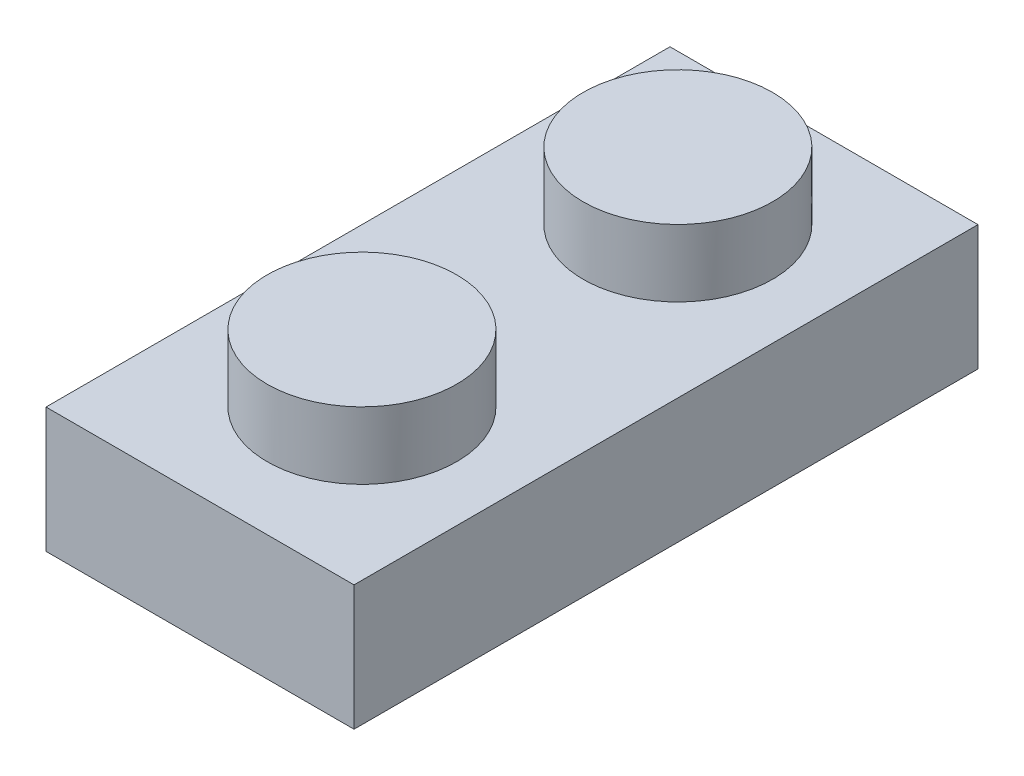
ISO-10303-21;
HEADER;
FILE_DESCRIPTION(('STEP AP214'),'2;1');
FILE_NAME('part.step','',(''),(''),'','','');
FILE_SCHEMA(('AUTOMOTIVE_DESIGN { 1 0 10303 214 1 1 1 1 }'));
ENDSEC;
DATA;
#1=APPLICATION_CONTEXT('core data for automotive mechanical design processes');
#2=APPLICATION_PROTOCOL_DEFINITION('international standard','automotive_design',2000,#1);
#3=PRODUCT_CONTEXT('',#1,'mechanical');
#4=PRODUCT('Part','Part','',(#3));
#5=PRODUCT_RELATED_PRODUCT_CATEGORY('part','',(#4));
#6=PRODUCT_DEFINITION_FORMATION('','',#4);
#7=PRODUCT_DEFINITION_CONTEXT('part definition',#1,'design');
#8=PRODUCT_DEFINITION('design','',#6,#7);
#9=PRODUCT_DEFINITION_SHAPE('','',#8);
#10=(LENGTH_UNIT() NAMED_UNIT(*) SI_UNIT(.MILLI.,.METRE.));
#11=(NAMED_UNIT(*) PLANE_ANGLE_UNIT() SI_UNIT($,.RADIAN.));
#12=(NAMED_UNIT(*) SI_UNIT($,.STERADIAN.) SOLID_ANGLE_UNIT());
#13=UNCERTAINTY_MEASURE_WITH_UNIT(LENGTH_MEASURE(1.E-05),#10,'distance_accuracy_value','');
#14=(GEOMETRIC_REPRESENTATION_CONTEXT(3) GLOBAL_UNCERTAINTY_ASSIGNED_CONTEXT((#13)) GLOBAL_UNIT_ASSIGNED_CONTEXT((#10,
#11,#12)) REPRESENTATION_CONTEXT('',''));
#15=CARTESIAN_POINT('',(0.,0.,0.));
#16=DIRECTION('',(0.,0.,1.));
#17=DIRECTION('',(1.,0.,0.));
#18=AXIS2_PLACEMENT_3D('',#15,#16,#17);
#19=CARTESIAN_POINT('',(0.,3.166,-15.8));
#20=DIRECTION('',(0.,-1.,0.));
#21=DIRECTION('',(0.,0.,-1.));
#22=AXIS2_PLACEMENT_3D('',#19,#20,#21);
#23=PLANE('',#22);
#24=CARTESIAN_POINT('',(4.,3.166,-4.));
#25=DIRECTION('',(0.,-1.,0.));
#26=DIRECTION('',(0.,0.,-1.));
#27=AXIS2_PLACEMENT_3D('',#24,#25,#26);
#28=CIRCLE('',#27,2.4);
#29=CARTESIAN_POINT('',(4.,3.166,-6.4));
#30=VERTEX_POINT('',#29);
#31=EDGE_CURVE('E45',#30,#30,#28,.F.);
#32=ORIENTED_EDGE('',*,*,#31,.F.);
#33=EDGE_LOOP('',(#32));
#34=FACE_BOUND('',#33,.T.);
#35=DIRECTION('',(0.,0.,1.));
#36=VECTOR('',#35,1.);
#37=CARTESIAN_POINT('',(0.,3.166,0.));
#38=LINE('',#37,#36);
#39=CARTESIAN_POINT('',(0.,3.166,-15.8));
#40=VERTEX_POINT('',#39);
#41=CARTESIAN_POINT('',(0.,3.166,0.));
#42=VERTEX_POINT('',#41);
#43=EDGE_CURVE('E198',#40,#42,#38,.T.);
#44=ORIENTED_EDGE('',*,*,#43,.T.);
#45=DIRECTION('',(1.,0.,0.));
#46=VECTOR('',#45,1.);
#47=CARTESIAN_POINT('',(0.,3.166,0.));
#48=LINE('',#47,#46);
#49=CARTESIAN_POINT('',(7.8,3.166,0.));
#50=VERTEX_POINT('',#49);
#51=EDGE_CURVE('E201',#42,#50,#48,.T.);
#52=ORIENTED_EDGE('',*,*,#51,.T.);
#53=DIRECTION('',(0.,0.,-1.));
#54=VECTOR('',#53,1.);
#55=CARTESIAN_POINT('',(7.8,3.166,0.));
#56=LINE('',#55,#54);
#57=CARTESIAN_POINT('',(7.8,3.166,-15.8));
#58=VERTEX_POINT('',#57);
#59=EDGE_CURVE('E204',#50,#58,#56,.T.);
#60=ORIENTED_EDGE('',*,*,#59,.T.);
#61=DIRECTION('',(-1.,0.,0.));
#62=VECTOR('',#61,1.);
#63=CARTESIAN_POINT('',(0.,3.166,-15.8));
#64=LINE('',#63,#62);
#65=EDGE_CURVE('E206',#58,#40,#64,.T.);
#66=ORIENTED_EDGE('',*,*,#65,.T.);
#67=EDGE_LOOP('',(#44,#52,#60,#66));
#68=FACE_BOUND('',#67,.T.);
#69=CARTESIAN_POINT('',(4.,3.166,-12.));
#70=DIRECTION('',(0.,-1.,0.));
#71=DIRECTION('',(0.,0.,-1.));
#72=AXIS2_PLACEMENT_3D('',#69,#70,#71);
#73=CIRCLE('',#72,2.4);
#74=CARTESIAN_POINT('',(4.,3.166,-14.4));
#75=VERTEX_POINT('',#74);
#76=EDGE_CURVE('E11',#75,#75,#73,.F.);
#77=ORIENTED_EDGE('',*,*,#76,.F.);
#78=EDGE_LOOP('',(#77));
#79=FACE_BOUND('',#78,.T.);
#80=ADVANCED_FACE('F37',(#34,#68,#79),#23,.F.);
#81=CARTESIAN_POINT('',(0.,3.166,0.));
#82=DIRECTION('',(1.,0.,0.));
#83=DIRECTION('',(0.,0.,-1.));
#84=AXIS2_PLACEMENT_3D('',#81,#82,#83);
#85=PLANE('',#84);
#86=DIRECTION('',(0.,0.,1.));
#87=VECTOR('',#86,1.);
#88=CARTESIAN_POINT('',(0.,0.,0.));
#89=LINE('',#88,#87);
#90=CARTESIAN_POINT('',(0.,0.,-15.8));
#91=VERTEX_POINT('',#90);
#92=CARTESIAN_POINT('',(0.,0.,0.));
#93=VERTEX_POINT('',#92);
#94=EDGE_CURVE('E197',#91,#93,#89,.T.);
#95=ORIENTED_EDGE('',*,*,#94,.T.);
#96=DIRECTION('',(0.,-1.,0.));
#97=VECTOR('',#96,1.);
#98=CARTESIAN_POINT('',(0.,3.166,0.));
#99=LINE('',#98,#97);
#100=EDGE_CURVE('E224',#42,#93,#99,.T.);
#101=ORIENTED_EDGE('',*,*,#100,.F.);
#102=ORIENTED_EDGE('',*,*,#43,.F.);
#103=DIRECTION('',(0.,-1.,0.));
#104=VECTOR('',#103,1.);
#105=CARTESIAN_POINT('',(0.,3.166,-15.8));
#106=LINE('',#105,#104);
#107=EDGE_CURVE('E208',#40,#91,#106,.T.);
#108=ORIENTED_EDGE('',*,*,#107,.T.);
#109=EDGE_LOOP('',(#95,#101,#102,#108));
#110=FACE_BOUND('',#109,.T.);
#111=ADVANCED_FACE('F39',(#110),#85,.F.);
#112=CARTESIAN_POINT('',(0.,3.166,0.));
#113=DIRECTION('',(0.,0.,-1.));
#114=DIRECTION('',(-1.,0.,0.));
#115=AXIS2_PLACEMENT_3D('',#112,#113,#114);
#116=PLANE('',#115);
#117=DIRECTION('',(1.,0.,0.));
#118=VECTOR('',#117,1.);
#119=CARTESIAN_POINT('',(0.,0.,0.));
#120=LINE('',#119,#118);
#121=CARTESIAN_POINT('',(7.8,0.,0.));
#122=VERTEX_POINT('',#121);
#123=EDGE_CURVE('E211',#93,#122,#120,.T.);
#124=ORIENTED_EDGE('',*,*,#123,.T.);
#125=DIRECTION('',(0.,-1.,0.));
#126=VECTOR('',#125,1.);
#127=CARTESIAN_POINT('',(7.8,3.166,0.));
#128=LINE('',#127,#126);
#129=EDGE_CURVE('E221',#50,#122,#128,.T.);
#130=ORIENTED_EDGE('',*,*,#129,.F.);
#131=ORIENTED_EDGE('',*,*,#51,.F.);
#132=ORIENTED_EDGE('',*,*,#100,.T.);
#133=EDGE_LOOP('',(#124,#130,#131,#132));
#134=FACE_BOUND('',#133,.T.);
#135=ADVANCED_FACE('F395',(#134),#116,.F.);
#136=CARTESIAN_POINT('',(7.8,3.166,0.));
#137=DIRECTION('',(-1.,0.,0.));
#138=DIRECTION('',(0.,0.,1.));
#139=AXIS2_PLACEMENT_3D('',#136,#137,#138);
#140=PLANE('',#139);
#141=DIRECTION('',(0.,0.,-1.));
#142=VECTOR('',#141,1.);
#143=CARTESIAN_POINT('',(7.8,0.,0.));
#144=LINE('',#143,#142);
#145=CARTESIAN_POINT('',(7.8,0.,-15.8));
#146=VERTEX_POINT('',#145);
#147=EDGE_CURVE('E213',#122,#146,#144,.T.);
#148=ORIENTED_EDGE('',*,*,#147,.T.);
#149=DIRECTION('',(0.,-1.,0.));
#150=VECTOR('',#149,1.);
#151=CARTESIAN_POINT('',(7.8,3.166,-15.8));
#152=LINE('',#151,#150);
#153=EDGE_CURVE('E218',#58,#146,#152,.T.);
#154=ORIENTED_EDGE('',*,*,#153,.F.);
#155=ORIENTED_EDGE('',*,*,#59,.F.);
#156=ORIENTED_EDGE('',*,*,#129,.T.);
#157=EDGE_LOOP('',(#148,#154,#155,#156));
#158=FACE_BOUND('',#157,.T.);
#159=ADVANCED_FACE('F386',(#158),#140,.F.);
#160=CARTESIAN_POINT('',(0.,3.166,-15.8));
#161=DIRECTION('',(0.,0.,1.));
#162=DIRECTION('',(1.,0.,0.));
#163=AXIS2_PLACEMENT_3D('',#160,#161,#162);
#164=PLANE('',#163);
#165=DIRECTION('',(-1.,0.,0.));
#166=VECTOR('',#165,1.);
#167=CARTESIAN_POINT('',(0.,0.,-15.8));
#168=LINE('',#167,#166);
#169=EDGE_CURVE('E202',#146,#91,#168,.T.);
#170=ORIENTED_EDGE('',*,*,#169,.T.);
#171=ORIENTED_EDGE('',*,*,#107,.F.);
#172=ORIENTED_EDGE('',*,*,#65,.F.);
#173=ORIENTED_EDGE('',*,*,#153,.T.);
#174=EDGE_LOOP('',(#170,#171,#172,#173));
#175=FACE_BOUND('',#174,.T.);
#176=ADVANCED_FACE('F378',(#175),#164,.F.);
#177=CARTESIAN_POINT('',(0.,0.,-15.8));
#178=DIRECTION('',(0.,-1.,0.));
#179=DIRECTION('',(0.,0.,-1.));
#180=AXIS2_PLACEMENT_3D('',#177,#178,#179);
#181=PLANE('',#180);
#182=DIRECTION('',(0.,0.,-1.));
#183=VECTOR('',#182,1.);
#184=CARTESIAN_POINT('',(1.45,0.,-1.45));
#185=LINE('',#184,#183);
#186=CARTESIAN_POINT('',(1.45,0.,-1.45));
#187=VERTEX_POINT('',#186);
#188=CARTESIAN_POINT('',(1.45,0.,-6.35));
#189=VERTEX_POINT('',#188);
#190=EDGE_CURVE('E52',#187,#189,#185,.T.);
#191=ORIENTED_EDGE('',*,*,#190,.F.);
#192=DIRECTION('',(-1.,0.,0.));
#193=VECTOR('',#192,1.);
#194=CARTESIAN_POINT('',(1.45,0.,-1.45));
#195=LINE('',#194,#193);
#196=CARTESIAN_POINT('',(6.35,0.,-1.45));
#197=VERTEX_POINT('',#196);
#198=EDGE_CURVE('E156',#197,#187,#195,.T.);
#199=ORIENTED_EDGE('',*,*,#198,.F.);
#200=DIRECTION('',(0.,0.,1.));
#201=VECTOR('',#200,1.);
#202=CARTESIAN_POINT('',(6.35,0.,-1.45));
#203=LINE('',#202,#201);
#204=CARTESIAN_POINT('',(6.35,0.,-6.35));
#205=VERTEX_POINT('',#204);
#206=EDGE_CURVE('E147',#205,#197,#203,.T.);
#207=ORIENTED_EDGE('',*,*,#206,.F.);
#208=DIRECTION('',(1.,0.,0.));
#209=VECTOR('',#208,1.);
#210=CARTESIAN_POINT('',(1.45,0.,-6.35));
#211=LINE('',#210,#209);
#212=EDGE_CURVE('E135',#189,#205,#211,.T.);
#213=ORIENTED_EDGE('',*,*,#212,.F.);
#214=EDGE_LOOP('',(#191,#199,#207,#213));
#215=FACE_BOUND('',#214,.T.);
#216=DIRECTION('',(0.,0.,-1.));
#217=VECTOR('',#216,1.);
#218=CARTESIAN_POINT('',(1.45,0.,-9.45));
#219=LINE('',#218,#217);
#220=CARTESIAN_POINT('',(1.45,0.,-9.45));
#221=VERTEX_POINT('',#220);
#222=CARTESIAN_POINT('',(1.45,0.,-14.35));
#223=VERTEX_POINT('',#222);
#224=EDGE_CURVE('E60',#221,#223,#219,.T.);
#225=ORIENTED_EDGE('',*,*,#224,.F.);
#226=DIRECTION('',(-1.,0.,0.));
#227=VECTOR('',#226,1.);
#228=CARTESIAN_POINT('',(1.45,0.,-9.45));
#229=LINE('',#228,#227);
#230=CARTESIAN_POINT('',(6.35,0.,-9.45));
#231=VERTEX_POINT('',#230);
#232=EDGE_CURVE('E168',#231,#221,#229,.T.);
#233=ORIENTED_EDGE('',*,*,#232,.F.);
#234=DIRECTION('',(0.,0.,1.));
#235=VECTOR('',#234,1.);
#236=CARTESIAN_POINT('',(6.35,0.,-9.45));
#237=LINE('',#236,#235);
#238=CARTESIAN_POINT('',(6.35,0.,-14.35));
#239=VERTEX_POINT('',#238);
#240=EDGE_CURVE('E182',#239,#231,#237,.T.);
#241=ORIENTED_EDGE('',*,*,#240,.F.);
#242=DIRECTION('',(1.,0.,0.));
#243=VECTOR('',#242,1.);
#244=CARTESIAN_POINT('',(1.45,0.,-14.35));
#245=LINE('',#244,#243);
#246=EDGE_CURVE('E179',#223,#239,#245,.T.);
#247=ORIENTED_EDGE('',*,*,#246,.F.);
#248=EDGE_LOOP('',(#225,#233,#241,#247));
#249=FACE_BOUND('',#248,.T.);
#250=ORIENTED_EDGE('',*,*,#94,.F.);
#251=ORIENTED_EDGE('',*,*,#169,.F.);
#252=ORIENTED_EDGE('',*,*,#147,.F.);
#253=ORIENTED_EDGE('',*,*,#123,.F.);
#254=EDGE_LOOP('',(#250,#251,#252,#253));
#255=FACE_BOUND('',#254,.T.);
#256=ADVANCED_FACE('F369',(#215,#249,#255),#181,.T.);
#257=CARTESIAN_POINT('',(4.,4.866,-4.));
#258=DIRECTION('',(0.,-1.,0.));
#259=DIRECTION('',(0.,0.,-1.));
#260=AXIS2_PLACEMENT_3D('',#257,#258,#259);
#261=CYLINDRICAL_SURFACE('',#260,2.4);
#262=CARTESIAN_POINT('',(4.,4.866,-4.));
#263=DIRECTION('',(0.,1.,0.));
#264=DIRECTION('',(0.,0.,1.));
#265=AXIS2_PLACEMENT_3D('',#262,#263,#264);
#266=CIRCLE('',#265,2.4);
#267=CARTESIAN_POINT('',(4.,4.866,-1.6));
#268=VERTEX_POINT('',#267);
#269=EDGE_CURVE('E189',#268,#268,#266,.T.);
#270=ORIENTED_EDGE('',*,*,#269,.F.);
#271=EDGE_LOOP('',(#270));
#272=FACE_BOUND('',#271,.T.);
#273=ORIENTED_EDGE('',*,*,#31,.T.);
#274=EDGE_LOOP('',(#273));
#275=FACE_BOUND('',#274,.T.);
#276=ADVANCED_FACE('F229',(#272,#275),#261,.T.);
#277=CARTESIAN_POINT('',(4.,4.866,-4.));
#278=DIRECTION('',(0.,1.,0.));
#279=DIRECTION('',(0.,0.,1.));
#280=AXIS2_PLACEMENT_3D('',#277,#278,#279);
#281=PLANE('',#280);
#282=ORIENTED_EDGE('',*,*,#269,.T.);
#283=EDGE_LOOP('',(#282));
#284=FACE_BOUND('',#283,.T.);
#285=ADVANCED_FACE('F353',(#284),#281,.T.);
#286=CARTESIAN_POINT('',(1.45,2.5,-9.45));
#287=DIRECTION('',(-1.,0.,0.));
#288=DIRECTION('',(0.,0.,1.));
#289=AXIS2_PLACEMENT_3D('',#286,#287,#288);
#290=PLANE('',#289);
#291=ORIENTED_EDGE('',*,*,#224,.T.);
#292=DIRECTION('',(0.,-1.,0.));
#293=VECTOR('',#292,1.);
#294=CARTESIAN_POINT('',(1.45,2.5,-14.35));
#295=LINE('',#294,#293);
#296=CARTESIAN_POINT('',(1.45,2.5,-14.35));
#297=VERTEX_POINT('',#296);
#298=EDGE_CURVE('E177',#297,#223,#295,.T.);
#299=ORIENTED_EDGE('',*,*,#298,.F.);
#300=DIRECTION('',(0.,0.,-1.));
#301=VECTOR('',#300,1.);
#302=CARTESIAN_POINT('',(1.45,2.5,-9.45));
#303=LINE('',#302,#301);
#304=CARTESIAN_POINT('',(1.45,2.5,-9.45));
#305=VERTEX_POINT('',#304);
#306=EDGE_CURVE('E164',#305,#297,#303,.T.);
#307=ORIENTED_EDGE('',*,*,#306,.F.);
#308=DIRECTION('',(0.,-1.,0.));
#309=VECTOR('',#308,1.);
#310=CARTESIAN_POINT('',(1.45,2.5,-9.45));
#311=LINE('',#310,#309);
#312=EDGE_CURVE('E187',#305,#221,#311,.T.);
#313=ORIENTED_EDGE('',*,*,#312,.T.);
#314=EDGE_LOOP('',(#291,#299,#307,#313));
#315=FACE_BOUND('',#314,.T.);
#316=ADVANCED_FACE('F344',(#315),#290,.F.);
#317=CARTESIAN_POINT('',(1.45,2.5,-9.45));
#318=DIRECTION('',(0.,0.,1.));
#319=DIRECTION('',(1.,0.,0.));
#320=AXIS2_PLACEMENT_3D('',#317,#318,#319);
#321=PLANE('',#320);
#322=ORIENTED_EDGE('',*,*,#232,.T.);
#323=ORIENTED_EDGE('',*,*,#312,.F.);
#324=DIRECTION('',(-1.,0.,0.));
#325=VECTOR('',#324,1.);
#326=CARTESIAN_POINT('',(1.45,2.5,-9.45));
#327=LINE('',#326,#325);
#328=CARTESIAN_POINT('',(6.35,2.5,-9.45));
#329=VERTEX_POINT('',#328);
#330=EDGE_CURVE('E174',#329,#305,#327,.T.);
#331=ORIENTED_EDGE('',*,*,#330,.F.);
#332=DIRECTION('',(0.,-1.,0.));
#333=VECTOR('',#332,1.);
#334=CARTESIAN_POINT('',(6.35,2.5,-9.45));
#335=LINE('',#334,#333);
#336=EDGE_CURVE('E190',#329,#231,#335,.T.);
#337=ORIENTED_EDGE('',*,*,#336,.T.);
#338=EDGE_LOOP('',(#322,#323,#331,#337));
#339=FACE_BOUND('',#338,.T.);
#340=ADVANCED_FACE('F335',(#339),#321,.F.);
#341=CARTESIAN_POINT('',(6.35,2.5,-9.45));
#342=DIRECTION('',(1.,0.,0.));
#343=DIRECTION('',(0.,0.,-1.));
#344=AXIS2_PLACEMENT_3D('',#341,#342,#343);
#345=PLANE('',#344);
#346=ORIENTED_EDGE('',*,*,#240,.T.);
#347=ORIENTED_EDGE('',*,*,#336,.F.);
#348=DIRECTION('',(0.,0.,1.));
#349=VECTOR('',#348,1.);
#350=CARTESIAN_POINT('',(6.35,2.5,-9.45));
#351=LINE('',#350,#349);
#352=CARTESIAN_POINT('',(6.35,2.5,-14.35));
#353=VERTEX_POINT('',#352);
#354=EDGE_CURVE('E171',#353,#329,#351,.T.);
#355=ORIENTED_EDGE('',*,*,#354,.F.);
#356=DIRECTION('',(0.,-1.,0.));
#357=VECTOR('',#356,1.);
#358=CARTESIAN_POINT('',(6.35,2.5,-14.35));
#359=LINE('',#358,#357);
#360=EDGE_CURVE('E192',#353,#239,#359,.T.);
#361=ORIENTED_EDGE('',*,*,#360,.T.);
#362=EDGE_LOOP('',(#346,#347,#355,#361));
#363=FACE_BOUND('',#362,.T.);
#364=ADVANCED_FACE('F326',(#363),#345,.F.);
#365=CARTESIAN_POINT('',(1.45,2.5,-14.35));
#366=DIRECTION('',(0.,0.,-1.));
#367=DIRECTION('',(-1.,0.,0.));
#368=AXIS2_PLACEMENT_3D('',#365,#366,#367);
#369=PLANE('',#368);
#370=ORIENTED_EDGE('',*,*,#246,.T.);
#371=ORIENTED_EDGE('',*,*,#360,.F.);
#372=DIRECTION('',(1.,0.,0.));
#373=VECTOR('',#372,1.);
#374=CARTESIAN_POINT('',(1.45,2.5,-14.35));
#375=LINE('',#374,#373);
#376=EDGE_CURVE('E167',#297,#353,#375,.T.);
#377=ORIENTED_EDGE('',*,*,#376,.F.);
#378=ORIENTED_EDGE('',*,*,#298,.T.);
#379=EDGE_LOOP('',(#370,#371,#377,#378));
#380=FACE_BOUND('',#379,.T.);
#381=ADVANCED_FACE('F251',(#380),#369,.F.);
#382=CARTESIAN_POINT('',(1.45,2.5,-14.35));
#383=DIRECTION('',(0.,-1.,0.));
#384=DIRECTION('',(0.,0.,-1.));
#385=AXIS2_PLACEMENT_3D('',#382,#383,#384);
#386=PLANE('',#385);
#387=ORIENTED_EDGE('',*,*,#306,.T.);
#388=ORIENTED_EDGE('',*,*,#376,.T.);
#389=ORIENTED_EDGE('',*,*,#354,.T.);
#390=ORIENTED_EDGE('',*,*,#330,.T.);
#391=EDGE_LOOP('',(#387,#388,#389,#390));
#392=FACE_BOUND('',#391,.T.);
#393=ADVANCED_FACE('F242',(#392),#386,.T.);
#394=CARTESIAN_POINT('',(4.,4.866,-12.));
#395=DIRECTION('',(0.,-1.,0.));
#396=DIRECTION('',(0.,0.,-1.));
#397=AXIS2_PLACEMENT_3D('',#394,#395,#396);
#398=CYLINDRICAL_SURFACE('',#397,2.4);
#399=CARTESIAN_POINT('',(4.,4.866,-12.));
#400=DIRECTION('',(0.,1.,0.));
#401=DIRECTION('',(0.,0.,1.));
#402=AXIS2_PLACEMENT_3D('',#399,#400,#401);
#403=CIRCLE('',#402,2.4);
#404=CARTESIAN_POINT('',(4.,4.866,-9.6));
#405=VERTEX_POINT('',#404);
#406=EDGE_CURVE('E161',#405,#405,#403,.T.);
#407=ORIENTED_EDGE('',*,*,#406,.F.);
#408=EDGE_LOOP('',(#407));
#409=FACE_BOUND('',#408,.T.);
#410=ORIENTED_EDGE('',*,*,#76,.T.);
#411=EDGE_LOOP('',(#410));
#412=FACE_BOUND('',#411,.T.);
#413=ADVANCED_FACE('F239',(#409,#412),#398,.T.);
#414=CARTESIAN_POINT('',(4.,4.866,-12.));
#415=DIRECTION('',(0.,1.,0.));
#416=DIRECTION('',(0.,0.,1.));
#417=AXIS2_PLACEMENT_3D('',#414,#415,#416);
#418=PLANE('',#417);
#419=ORIENTED_EDGE('',*,*,#406,.T.);
#420=EDGE_LOOP('',(#419));
#421=FACE_BOUND('',#420,.T.);
#422=ADVANCED_FACE('F241',(#421),#418,.T.);
#423=CARTESIAN_POINT('',(1.45,2.5,-1.45));
#424=DIRECTION('',(-1.,0.,0.));
#425=DIRECTION('',(0.,0.,1.));
#426=AXIS2_PLACEMENT_3D('',#423,#424,#425);
#427=PLANE('',#426);
#428=ORIENTED_EDGE('',*,*,#190,.T.);
#429=DIRECTION('',(0.,-1.,0.));
#430=VECTOR('',#429,1.);
#431=CARTESIAN_POINT('',(1.45,2.5,-6.35));
#432=LINE('',#431,#430);
#433=CARTESIAN_POINT('',(1.45,2.5,-6.35));
#434=VERTEX_POINT('',#433);
#435=EDGE_CURVE('E140',#434,#189,#432,.T.);
#436=ORIENTED_EDGE('',*,*,#435,.F.);
#437=DIRECTION('',(0.,0.,-1.));
#438=VECTOR('',#437,1.);
#439=CARTESIAN_POINT('',(1.45,2.5,-1.45));
#440=LINE('',#439,#438);
#441=CARTESIAN_POINT('',(1.45,2.5,-1.45));
#442=VERTEX_POINT('',#441);
#443=EDGE_CURVE('E127',#442,#434,#440,.T.);
#444=ORIENTED_EDGE('',*,*,#443,.F.);
#445=DIRECTION('',(0.,-1.,0.));
#446=VECTOR('',#445,1.);
#447=CARTESIAN_POINT('',(1.45,2.5,-1.45));
#448=LINE('',#447,#446);
#449=EDGE_CURVE('E158',#442,#187,#448,.T.);
#450=ORIENTED_EDGE('',*,*,#449,.T.);
#451=EDGE_LOOP('',(#428,#436,#444,#450));
#452=FACE_BOUND('',#451,.T.);
#453=ADVANCED_FACE('F146',(#452),#427,.F.);
#454=CARTESIAN_POINT('',(1.45,2.5,-1.45));
#455=DIRECTION('',(0.,0.,1.));
#456=DIRECTION('',(1.,0.,0.));
#457=AXIS2_PLACEMENT_3D('',#454,#455,#456);
#458=PLANE('',#457);
#459=ORIENTED_EDGE('',*,*,#198,.T.);
#460=ORIENTED_EDGE('',*,*,#449,.F.);
#461=DIRECTION('',(-1.,0.,0.));
#462=VECTOR('',#461,1.);
#463=CARTESIAN_POINT('',(1.45,2.5,-1.45));
#464=LINE('',#463,#462);
#465=CARTESIAN_POINT('',(6.35,2.5,-1.45));
#466=VERTEX_POINT('',#465);
#467=EDGE_CURVE('E133',#466,#442,#464,.T.);
#468=ORIENTED_EDGE('',*,*,#467,.F.);
#469=DIRECTION('',(0.,-1.,0.));
#470=VECTOR('',#469,1.);
#471=CARTESIAN_POINT('',(6.35,2.5,-1.45));
#472=LINE('',#471,#470);
#473=EDGE_CURVE('E149',#466,#197,#472,.T.);
#474=ORIENTED_EDGE('',*,*,#473,.T.);
#475=EDGE_LOOP('',(#459,#460,#468,#474));
#476=FACE_BOUND('',#475,.T.);
#477=ADVANCED_FACE('F265',(#476),#458,.F.);
#478=CARTESIAN_POINT('',(6.35,2.5,-1.45));
#479=DIRECTION('',(1.,0.,0.));
#480=DIRECTION('',(0.,0.,-1.));
#481=AXIS2_PLACEMENT_3D('',#478,#479,#480);
#482=PLANE('',#481);
#483=ORIENTED_EDGE('',*,*,#206,.T.);
#484=ORIENTED_EDGE('',*,*,#473,.F.);
#485=DIRECTION('',(0.,0.,1.));
#486=VECTOR('',#485,1.);
#487=CARTESIAN_POINT('',(6.35,2.5,-1.45));
#488=LINE('',#487,#486);
#489=CARTESIAN_POINT('',(6.35,2.5,-6.35));
#490=VERTEX_POINT('',#489);
#491=EDGE_CURVE('E144',#490,#466,#488,.T.);
#492=ORIENTED_EDGE('',*,*,#491,.F.);
#493=DIRECTION('',(0.,-1.,0.));
#494=VECTOR('',#493,1.);
#495=CARTESIAN_POINT('',(6.35,2.5,-6.35));
#496=LINE('',#495,#494);
#497=EDGE_CURVE('E143',#490,#205,#496,.T.);
#498=ORIENTED_EDGE('',*,*,#497,.T.);
#499=EDGE_LOOP('',(#483,#484,#492,#498));
#500=FACE_BOUND('',#499,.T.);
#501=ADVANCED_FACE('F260',(#500),#482,.F.);
#502=CARTESIAN_POINT('',(1.45,2.5,-6.35));
#503=DIRECTION('',(0.,0.,-1.));
#504=DIRECTION('',(-1.,0.,0.));
#505=AXIS2_PLACEMENT_3D('',#502,#503,#504);
#506=PLANE('',#505);
#507=ORIENTED_EDGE('',*,*,#212,.T.);
#508=ORIENTED_EDGE('',*,*,#497,.F.);
#509=DIRECTION('',(1.,0.,0.));
#510=VECTOR('',#509,1.);
#511=CARTESIAN_POINT('',(1.45,2.5,-6.35));
#512=LINE('',#511,#510);
#513=EDGE_CURVE('E130',#434,#490,#512,.T.);
#514=ORIENTED_EDGE('',*,*,#513,.F.);
#515=ORIENTED_EDGE('',*,*,#435,.T.);
#516=EDGE_LOOP('',(#507,#508,#514,#515));
#517=FACE_BOUND('',#516,.T.);
#518=ADVANCED_FACE('F139',(#517),#506,.F.);
#519=CARTESIAN_POINT('',(1.45,2.5,-6.35));
#520=DIRECTION('',(0.,-1.,0.));
#521=DIRECTION('',(0.,0.,-1.));
#522=AXIS2_PLACEMENT_3D('',#519,#520,#521);
#523=PLANE('',#522);
#524=ORIENTED_EDGE('',*,*,#443,.T.);
#525=ORIENTED_EDGE('',*,*,#513,.T.);
#526=ORIENTED_EDGE('',*,*,#491,.T.);
#527=ORIENTED_EDGE('',*,*,#467,.T.);
#528=EDGE_LOOP('',(#524,#525,#526,#527));
#529=FACE_BOUND('',#528,.T.);
#530=ADVANCED_FACE('F129',(#529),#523,.T.);
#531=CLOSED_SHELL('',(#80,#111,#135,#159,#176,#256,#276,#285,#316,#340,#364,#381,#393,#413,#422,
#453,#477,#501,#518,#530));
#532=MANIFOLD_SOLID_BREP('B2',#531);
#533=ADVANCED_BREP_SHAPE_REPRESENTATION('',(#18,#532),#14);
#534=SHAPE_DEFINITION_REPRESENTATION(#9,#533);
ENDSEC;
END-ISO-10303-21;
